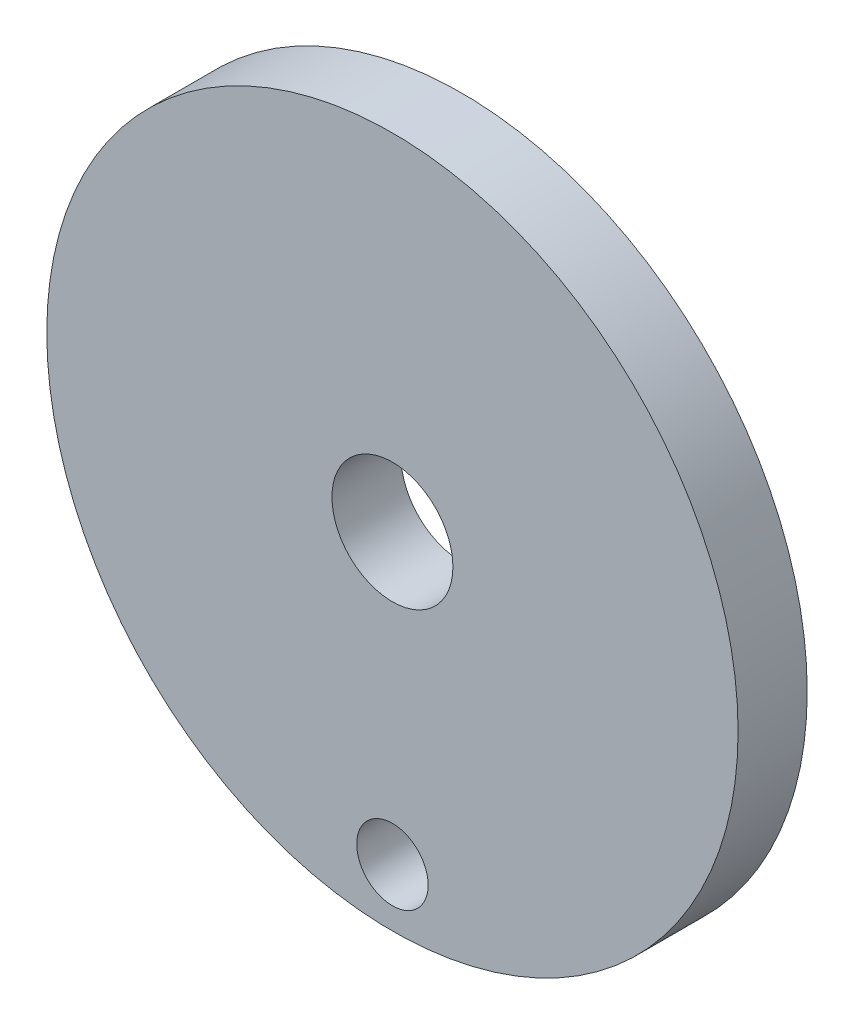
from build123d import *

# Parameters (mm, degrees)
ESQUISSE1_R      = 30
ESQUISSE1_R_2    = 5.25
ESQUISSE1_R_3    = 3.1
EXTRUSION1_DEPTH = 6


with BuildPart() as part:
    # Esquisse1 → Extrusion1 (new body)
    with BuildSketch(Plane.XY):
        Circle(ESQUISSE1_R)
        Circle(ESQUISSE1_R_2, mode=Mode.SUBTRACT)
        with Locations((0, -25)):
            Circle(ESQUISSE1_R_3, mode=Mode.SUBTRACT)
    extrude(amount=EXTRUSION1_DEPTH)


solid = part.part
